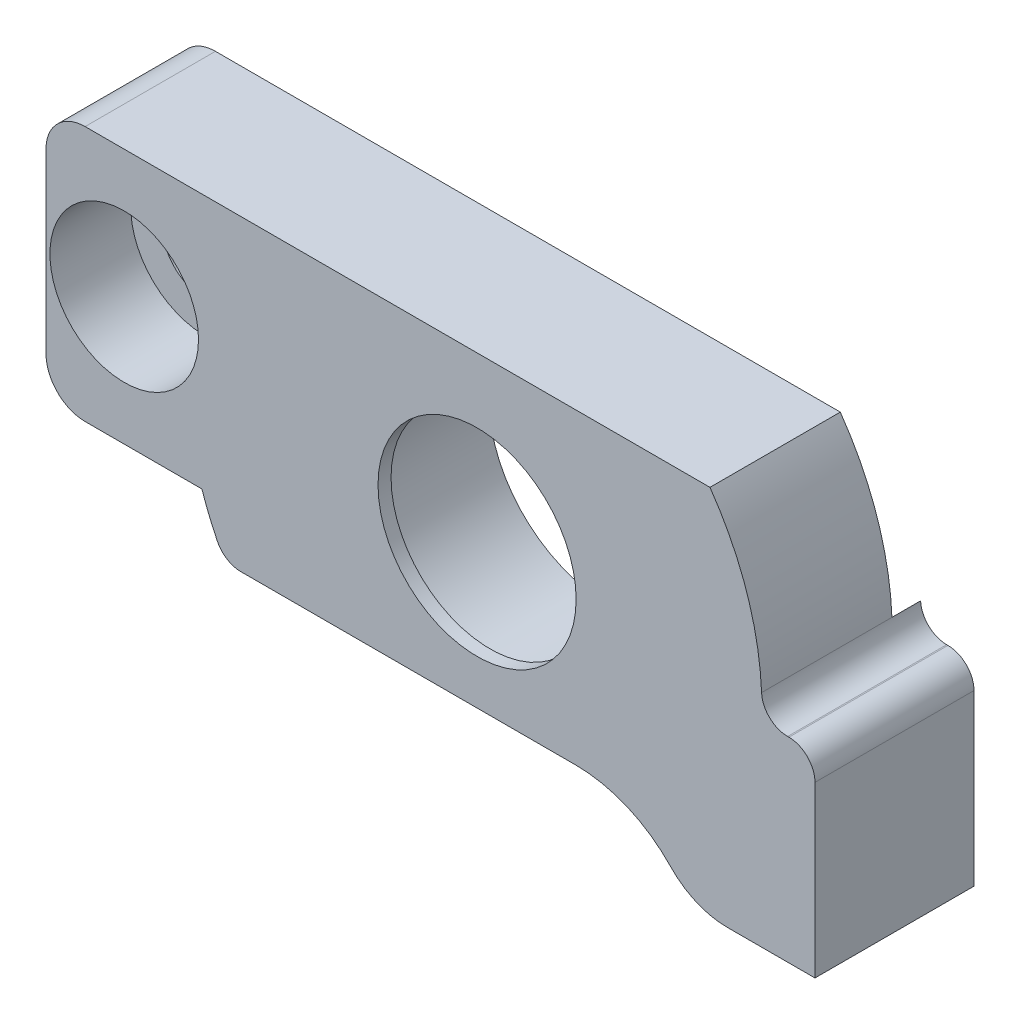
ISO-10303-21;
HEADER;
FILE_DESCRIPTION(('STEP AP214'),'2;1');
FILE_NAME('part.step','',(''),(''),'','','');
FILE_SCHEMA(('AUTOMOTIVE_DESIGN { 1 0 10303 214 1 1 1 1 }'));
ENDSEC;
DATA;
#1=APPLICATION_CONTEXT('core data for automotive mechanical design processes');
#2=APPLICATION_PROTOCOL_DEFINITION('international standard','automotive_design',2000,#1);
#3=PRODUCT_CONTEXT('',#1,'mechanical');
#4=PRODUCT('Part','Part','',(#3));
#5=PRODUCT_RELATED_PRODUCT_CATEGORY('part','',(#4));
#6=PRODUCT_DEFINITION_FORMATION('','',#4);
#7=PRODUCT_DEFINITION_CONTEXT('part definition',#1,'design');
#8=PRODUCT_DEFINITION('design','',#6,#7);
#9=PRODUCT_DEFINITION_SHAPE('','',#8);
#10=(LENGTH_UNIT() NAMED_UNIT(*) SI_UNIT(.MILLI.,.METRE.));
#11=(NAMED_UNIT(*) PLANE_ANGLE_UNIT() SI_UNIT($,.RADIAN.));
#12=(NAMED_UNIT(*) SI_UNIT($,.STERADIAN.) SOLID_ANGLE_UNIT());
#13=UNCERTAINTY_MEASURE_WITH_UNIT(LENGTH_MEASURE(1.E-05),#10,'distance_accuracy_value','');
#14=(GEOMETRIC_REPRESENTATION_CONTEXT(3) GLOBAL_UNCERTAINTY_ASSIGNED_CONTEXT((#13)) GLOBAL_UNIT_ASSIGNED_CONTEXT((#10,
#11,#12)) REPRESENTATION_CONTEXT('',''));
#15=CARTESIAN_POINT('',(0.,0.,0.));
#16=DIRECTION('',(0.,0.,1.));
#17=DIRECTION('',(1.,0.,0.));
#18=AXIS2_PLACEMENT_3D('',#15,#16,#17);
#19=CARTESIAN_POINT('',(12.5,-4.4,-2.4));
#20=DIRECTION('',(-1.,0.,0.));
#21=DIRECTION('',(0.,0.,1.));
#22=AXIS2_PLACEMENT_3D('',#19,#20,#21);
#23=PLANE('',#22);
#24=DIRECTION('',(0.,0.,-1.));
#25=VECTOR('',#24,1.);
#26=CARTESIAN_POINT('',(12.5,-7.2957063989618,13.4233560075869));
#27=LINE('',#26,#25);
#28=CARTESIAN_POINT('',(12.5,-7.2957063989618,0.));
#29=VERTEX_POINT('',#28);
#30=CARTESIAN_POINT('',(12.5,-7.2957063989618,-1.1));
#31=VERTEX_POINT('',#30);
#32=EDGE_CURVE('E178',#29,#31,#27,.T.);
#33=ORIENTED_EDGE('',*,*,#32,.T.);
#34=DIRECTION('',(0.,1.,0.));
#35=VECTOR('',#34,1.);
#36=CARTESIAN_POINT('',(12.5,-8.16413899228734,-1.1));
#37=LINE('',#36,#35);
#38=CARTESIAN_POINT('',(12.5,-8.16413899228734,-1.1));
#39=VERTEX_POINT('',#38);
#40=EDGE_CURVE('E52',#39,#31,#37,.T.);
#41=ORIENTED_EDGE('',*,*,#40,.F.);
#42=DIRECTION('',(0.,0.,-1.));
#43=VECTOR('',#42,1.);
#44=CARTESIAN_POINT('',(12.5,-8.16413899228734,6.00435974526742));
#45=LINE('',#44,#43);
#46=CARTESIAN_POINT('',(12.5,-8.16413899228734,0.));
#47=VERTEX_POINT('',#46);
#48=EDGE_CURVE('E175',#47,#39,#45,.T.);
#49=ORIENTED_EDGE('',*,*,#48,.F.);
#50=DIRECTION('',(0.,1.,0.));
#51=VECTOR('',#50,1.);
#52=CARTESIAN_POINT('',(12.5,-4.4,0.));
#53=LINE('',#52,#51);
#54=EDGE_CURVE('E254',#47,#29,#53,.T.);
#55=ORIENTED_EDGE('',*,*,#54,.T.);
#56=EDGE_LOOP('',(#33,#41,#49,#55));
#57=FACE_BOUND('',#56,.T.);
#58=ADVANCED_FACE('F37',(#57),#23,.T.);
#59=CARTESIAN_POINT('',(14.9616699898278,-0.887184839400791,-2.4));
#60=DIRECTION('',(0.,1.,0.));
#61=DIRECTION('',(-1.,0.,0.));
#62=AXIS2_PLACEMENT_3D('',#59,#60,#61);
#63=PLANE('',#62);
#64=DIRECTION('',(0.,0.,1.));
#65=VECTOR('',#64,1.);
#66=CARTESIAN_POINT('',(16.0000000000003,-0.887184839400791,-2.4));
#67=LINE('',#66,#65);
#68=CARTESIAN_POINT('',(16.0000000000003,-0.887184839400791,5.));
#69=VERTEX_POINT('',#68);
#70=CARTESIAN_POINT('',(16.0000000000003,-0.887184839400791,-1.1));
#71=VERTEX_POINT('',#70);
#72=EDGE_CURVE('E277',#69,#71,#67,.F.);
#73=ORIENTED_EDGE('',*,*,#72,.T.);
#74=DIRECTION('',(1.,0.,0.));
#75=VECTOR('',#74,1.);
#76=CARTESIAN_POINT('',(15.9511831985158,-0.88718483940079,-1.1));
#77=LINE('',#76,#75);
#78=CARTESIAN_POINT('',(15.9511831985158,-0.887184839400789,-1.1));
#79=VERTEX_POINT('',#78);
#80=EDGE_CURVE('E338',#79,#71,#77,.T.);
#81=ORIENTED_EDGE('',*,*,#80,.F.);
#82=DIRECTION('',(0.,0.,-1.));
#83=VECTOR('',#82,1.);
#84=CARTESIAN_POINT('',(15.9511831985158,-0.887184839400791,5.));
#85=LINE('',#84,#83);
#86=CARTESIAN_POINT('',(15.9511831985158,-0.887184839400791,5.));
#87=VERTEX_POINT('',#86);
#88=EDGE_CURVE('E284',#79,#87,#85,.F.);
#89=ORIENTED_EDGE('',*,*,#88,.T.);
#90=DIRECTION('',(-1.,0.,0.));
#91=VECTOR('',#90,1.);
#92=CARTESIAN_POINT('',(14.9616699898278,-0.887184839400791,5.));
#93=LINE('',#92,#91);
#94=EDGE_CURVE('E207',#69,#87,#93,.T.);
#95=ORIENTED_EDGE('',*,*,#94,.F.);
#96=EDGE_LOOP('',(#73,#81,#89,#95));
#97=FACE_BOUND('',#96,.T.);
#98=ADVANCED_FACE('F371',(#97),#63,.T.);
#99=CARTESIAN_POINT('',(17.0000000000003,-0.887184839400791,-2.4));
#100=DIRECTION('',(1.,0.,0.));
#101=DIRECTION('',(0.,0.,-1.));
#102=AXIS2_PLACEMENT_3D('',#99,#100,#101);
#103=PLANE('',#102);
#104=DIRECTION('',(0.,0.,1.));
#105=VECTOR('',#104,1.);
#106=CARTESIAN_POINT('',(17.0000000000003,-8.38718483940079,-2.4));
#107=LINE('',#106,#105);
#108=CARTESIAN_POINT('',(17.0000000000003,-8.38718483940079,-1.1));
#109=VERTEX_POINT('',#108);
#110=CARTESIAN_POINT('',(17.0000000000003,-8.38718483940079,5.));
#111=VERTEX_POINT('',#110);
#112=EDGE_CURVE('E211',#109,#111,#107,.T.);
#113=ORIENTED_EDGE('',*,*,#112,.F.);
#114=DIRECTION('',(0.,-1.,0.));
#115=VECTOR('',#114,1.);
#116=CARTESIAN_POINT('',(17.0000000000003,-1.88718483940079,-1.1));
#117=LINE('',#116,#115);
#118=CARTESIAN_POINT('',(17.0000000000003,-1.88718483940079,-1.1));
#119=VERTEX_POINT('',#118);
#120=EDGE_CURVE('E334',#119,#109,#117,.T.);
#121=ORIENTED_EDGE('',*,*,#120,.F.);
#122=DIRECTION('',(0.,0.,1.));
#123=VECTOR('',#122,1.);
#124=CARTESIAN_POINT('',(17.0000000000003,-1.88718483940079,-2.4));
#125=LINE('',#124,#123);
#126=CARTESIAN_POINT('',(17.0000000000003,-1.88718483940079,5.));
#127=VERTEX_POINT('',#126);
#128=EDGE_CURVE('E290',#119,#127,#125,.T.);
#129=ORIENTED_EDGE('',*,*,#128,.T.);
#130=DIRECTION('',(0.,1.,0.));
#131=VECTOR('',#130,1.);
#132=CARTESIAN_POINT('',(17.0000000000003,-0.887184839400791,5.));
#133=LINE('',#132,#131);
#134=EDGE_CURVE('E204',#111,#127,#133,.T.);
#135=ORIENTED_EDGE('',*,*,#134,.F.);
#136=EDGE_LOOP('',(#113,#121,#129,#135));
#137=FACE_BOUND('',#136,.T.);
#138=ADVANCED_FACE('F364',(#137),#103,.T.);
#139=CARTESIAN_POINT('',(17.0000000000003,-8.38718483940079,-2.4));
#140=DIRECTION('',(0.,-1.,0.));
#141=DIRECTION('',(1.,0.,0.));
#142=AXIS2_PLACEMENT_3D('',#139,#140,#141);
#143=PLANE('',#142);
#144=DIRECTION('',(0.,0.,1.));
#145=VECTOR('',#144,1.);
#146=CARTESIAN_POINT('',(13.6351324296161,-8.38718483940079,-2.4));
#147=LINE('',#146,#145);
#148=CARTESIAN_POINT('',(13.6351324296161,-8.38718483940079,5.));
#149=VERTEX_POINT('',#148);
#150=CARTESIAN_POINT('',(13.6351324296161,-8.38718483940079,-1.1));
#151=VERTEX_POINT('',#150);
#152=EDGE_CURVE('E300',#149,#151,#147,.F.);
#153=ORIENTED_EDGE('',*,*,#152,.T.);
#154=DIRECTION('',(-1.,0.,0.));
#155=VECTOR('',#154,1.);
#156=CARTESIAN_POINT('',(17.0000000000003,-8.38718483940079,-1.1));
#157=LINE('',#156,#155);
#158=EDGE_CURVE('E165',#109,#151,#157,.T.);
#159=ORIENTED_EDGE('',*,*,#158,.F.);
#160=ORIENTED_EDGE('',*,*,#112,.T.);
#161=DIRECTION('',(1.,0.,0.));
#162=VECTOR('',#161,1.);
#163=CARTESIAN_POINT('',(17.0000000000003,-8.38718483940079,5.));
#164=LINE('',#163,#162);
#165=EDGE_CURVE('E201',#149,#111,#164,.T.);
#166=ORIENTED_EDGE('',*,*,#165,.F.);
#167=EDGE_LOOP('',(#153,#159,#160,#166));
#168=FACE_BOUND('',#167,.T.);
#169=ADVANCED_FACE('F360',(#168),#143,.T.);
#170=CARTESIAN_POINT('',(15.9511831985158,0.112815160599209,-2.4));
#171=DIRECTION('',(0.,0.,1.));
#172=DIRECTION('',(1.,0.,0.));
#173=AXIS2_PLACEMENT_3D('',#170,#171,#172);
#174=CYLINDRICAL_SURFACE('',#173,1.);
#175=CARTESIAN_POINT('',(15.9511831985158,0.112815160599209,-1.1));
#176=DIRECTION('',(0.,0.,1.));
#177=DIRECTION('',(-1.,0.,0.));
#178=AXIS2_PLACEMENT_3D('',#175,#176,#177);
#179=CIRCLE('',#178,0.999999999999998);
#180=CARTESIAN_POINT('',(14.9520625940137,0.0708864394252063,-1.1));
#181=VERTEX_POINT('',#180);
#182=EDGE_CURVE('E340',#181,#79,#179,.T.);
#183=ORIENTED_EDGE('',*,*,#182,.F.);
#184=DIRECTION('',(0.,0.,1.));
#185=VECTOR('',#184,1.);
#186=CARTESIAN_POINT('',(14.9520625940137,0.0708864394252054,-2.4));
#187=LINE('',#186,#185);
#188=CARTESIAN_POINT('',(14.9520625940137,0.0708864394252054,0.));
#189=VERTEX_POINT('',#188);
#190=EDGE_CURVE('E286',#189,#181,#187,.F.);
#191=ORIENTED_EDGE('',*,*,#190,.F.);
#192=CARTESIAN_POINT('',(14.9520625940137,0.0708864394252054,5.));
#193=VERTEX_POINT('',#192);
#194=EDGE_CURVE('E287',#193,#189,#187,.F.);
#195=ORIENTED_EDGE('',*,*,#194,.F.);
#196=CARTESIAN_POINT('',(15.9511831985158,0.112815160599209,5.));
#197=DIRECTION('',(0.,0.,1.));
#198=DIRECTION('',(1.,0.,0.));
#199=AXIS2_PLACEMENT_3D('',#196,#197,#198);
#200=CIRCLE('',#199,1.);
#201=EDGE_CURVE('E294',#87,#193,#200,.F.);
#202=ORIENTED_EDGE('',*,*,#201,.F.);
#203=ORIENTED_EDGE('',*,*,#88,.F.);
#204=EDGE_LOOP('',(#183,#191,#195,#202,#203));
#205=FACE_BOUND('',#204,.T.);
#206=ADVANCED_FACE('F349',(#205),#174,.F.);
#207=CARTESIAN_POINT('',(16.0000000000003,-1.88718483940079,-2.4));
#208=DIRECTION('',(0.,0.,1.));
#209=DIRECTION('',(1.,0.,0.));
#210=AXIS2_PLACEMENT_3D('',#207,#208,#209);
#211=CYLINDRICAL_SURFACE('',#210,1.);
#212=ORIENTED_EDGE('',*,*,#128,.F.);
#213=CARTESIAN_POINT('',(16.0000000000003,-1.88718483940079,-1.1));
#214=DIRECTION('',(0.,0.,-1.));
#215=DIRECTION('',(-1.,0.,0.));
#216=AXIS2_PLACEMENT_3D('',#213,#214,#215);
#217=CIRCLE('',#216,1.);
#218=EDGE_CURVE('E336',#71,#119,#217,.T.);
#219=ORIENTED_EDGE('',*,*,#218,.F.);
#220=ORIENTED_EDGE('',*,*,#72,.F.);
#221=CARTESIAN_POINT('',(16.0000000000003,-1.88718483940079,5.));
#222=DIRECTION('',(0.,0.,1.));
#223=DIRECTION('',(1.,0.,0.));
#224=AXIS2_PLACEMENT_3D('',#221,#222,#223);
#225=CIRCLE('',#224,1.);
#226=EDGE_CURVE('E292',#127,#69,#225,.T.);
#227=ORIENTED_EDGE('',*,*,#226,.F.);
#228=EDGE_LOOP('',(#212,#219,#220,#227));
#229=FACE_BOUND('',#228,.T.);
#230=ADVANCED_FACE('F373',(#229),#211,.T.);
#231=CARTESIAN_POINT('',(13.6351324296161,-5.38718483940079,-2.4));
#232=DIRECTION('',(0.,0.,1.));
#233=DIRECTION('',(1.,0.,0.));
#234=AXIS2_PLACEMENT_3D('',#231,#232,#233);
#235=CYLINDRICAL_SURFACE('',#234,3.);
#236=ORIENTED_EDGE('',*,*,#48,.T.);
#237=CARTESIAN_POINT('',(13.6351324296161,-5.38718483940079,-1.1));
#238=DIRECTION('',(0.,0.,-1.));
#239=DIRECTION('',(-1.,0.,0.));
#240=AXIS2_PLACEMENT_3D('',#237,#238,#239);
#241=CIRCLE('',#240,3.);
#242=EDGE_CURVE('E162',#151,#39,#241,.T.);
#243=ORIENTED_EDGE('',*,*,#242,.F.);
#244=ORIENTED_EDGE('',*,*,#152,.F.);
#245=CARTESIAN_POINT('',(13.6351324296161,-5.38718483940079,5.));
#246=DIRECTION('',(0.,0.,1.));
#247=DIRECTION('',(1.,0.,0.));
#248=AXIS2_PLACEMENT_3D('',#245,#246,#247);
#249=CIRCLE('',#248,3.);
#250=CARTESIAN_POINT('',(11.465218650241,-7.45877219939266,5.));
#251=VERTEX_POINT('',#250);
#252=EDGE_CURVE('E298',#251,#149,#249,.T.);
#253=ORIENTED_EDGE('',*,*,#252,.F.);
#254=DIRECTION('',(0.,0.,1.));
#255=VECTOR('',#254,1.);
#256=CARTESIAN_POINT('',(11.465218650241,-7.45877219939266,-2.4));
#257=LINE('',#256,#255);
#258=CARTESIAN_POINT('',(11.465218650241,-7.45877219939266,0.));
#259=VERTEX_POINT('',#258);
#260=EDGE_CURVE('E296',#259,#251,#257,.T.);
#261=ORIENTED_EDGE('',*,*,#260,.F.);
#262=CARTESIAN_POINT('',(13.6351324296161,-5.38718483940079,0.));
#263=DIRECTION('',(0.,0.,1.));
#264=DIRECTION('',(1.,0.,0.));
#265=AXIS2_PLACEMENT_3D('',#262,#263,#264);
#266=CIRCLE('',#265,3.);
#267=EDGE_CURVE('E183',#47,#259,#266,.F.);
#268=ORIENTED_EDGE('',*,*,#267,.F.);
#269=EDGE_LOOP('',(#236,#243,#244,#253,#261,#268));
#270=FACE_BOUND('',#269,.T.);
#271=ADVANCED_FACE('F181',(#270),#235,.T.);
#272=CARTESIAN_POINT('',(4.03666998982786,-0.387184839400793,13.4233560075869));
#273=DIRECTION('',(0.,0.,-1.));
#274=DIRECTION('',(-1.,0.,0.));
#275=AXIS2_PLACEMENT_3D('',#272,#273,#274);
#276=CYLINDRICAL_SURFACE('',#275,10.925);
#277=CARTESIAN_POINT('',(4.03666998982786,-0.387184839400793,-1.1));
#278=DIRECTION('',(0.,0.,1.));
#279=DIRECTION('',(-1.,0.,0.));
#280=AXIS2_PLACEMENT_3D('',#277,#278,#279);
#281=CIRCLE('',#280,10.925);
#282=EDGE_CURVE('E179',#31,#181,#281,.T.);
#283=ORIENTED_EDGE('',*,*,#282,.F.);
#284=ORIENTED_EDGE('',*,*,#32,.F.);
#285=CARTESIAN_POINT('',(4.03666998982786,-0.387184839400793,0.));
#286=DIRECTION('',(0.,0.,1.));
#287=DIRECTION('',(1.,0.,0.));
#288=AXIS2_PLACEMENT_3D('',#285,#286,#287);
#289=CIRCLE('',#288,10.925);
#290=EDGE_CURVE('E332',#189,#29,#289,.F.);
#291=ORIENTED_EDGE('',*,*,#290,.F.);
#292=ORIENTED_EDGE('',*,*,#190,.T.);
#293=EDGE_LOOP('',(#283,#284,#291,#292));
#294=FACE_BOUND('',#293,.T.);
#295=ADVANCED_FACE('F352',(#294),#276,.F.);
#296=CARTESIAN_POINT('',(-11.,5.9,5.));
#297=DIRECTION('',(0.,-1.,0.));
#298=DIRECTION('',(0.,0.,-1.));
#299=AXIS2_PLACEMENT_3D('',#296,#297,#298);
#300=PLANE('',#299);
#301=DIRECTION('',(0.,0.,1.));
#302=VECTOR('',#301,1.);
#303=CARTESIAN_POINT('',(12.9712618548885,5.9,-2.4));
#304=LINE('',#303,#302);
#305=CARTESIAN_POINT('',(12.9712618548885,5.9,0.));
#306=VERTEX_POINT('',#305);
#307=CARTESIAN_POINT('',(12.9712618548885,5.9,5.));
#308=VERTEX_POINT('',#307);
#309=EDGE_CURVE('E210',#306,#308,#304,.T.);
#310=ORIENTED_EDGE('',*,*,#309,.F.);
#311=DIRECTION('',(-1.,0.,0.));
#312=VECTOR('',#311,1.);
#313=CARTESIAN_POINT('',(-11.,5.9,0.));
#314=LINE('',#313,#312);
#315=CARTESIAN_POINT('',(-11.,5.9,0.));
#316=VERTEX_POINT('',#315);
#317=EDGE_CURVE('E256',#306,#316,#314,.T.);
#318=ORIENTED_EDGE('',*,*,#317,.T.);
#319=DIRECTION('',(0.,0.,-1.));
#320=VECTOR('',#319,1.);
#321=CARTESIAN_POINT('',(-11.,5.9,5.));
#322=LINE('',#321,#320);
#323=CARTESIAN_POINT('',(-11.,5.9,5.));
#324=VERTEX_POINT('',#323);
#325=EDGE_CURVE('E274',#324,#316,#322,.T.);
#326=ORIENTED_EDGE('',*,*,#325,.F.);
#327=DIRECTION('',(-1.,0.,0.));
#328=VECTOR('',#327,1.);
#329=CARTESIAN_POINT('',(-11.,5.9,5.));
#330=LINE('',#329,#328);
#331=EDGE_CURVE('E240',#308,#324,#330,.T.);
#332=ORIENTED_EDGE('',*,*,#331,.F.);
#333=EDGE_LOOP('',(#310,#318,#326,#332));
#334=FACE_BOUND('',#333,.T.);
#335=ADVANCED_FACE('F438',(#334),#300,.F.);
#336=CARTESIAN_POINT('',(-4.49999999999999,-5.9,5.));
#337=DIRECTION('',(0.,1.,0.));
#338=DIRECTION('',(0.,0.,1.));
#339=AXIS2_PLACEMENT_3D('',#336,#337,#338);
#340=PLANE('',#339);
#341=DIRECTION('',(1.,0.,0.));
#342=VECTOR('',#341,1.);
#343=CARTESIAN_POINT('',(-4.49999999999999,-5.9,5.));
#344=LINE('',#343,#342);
#345=CARTESIAN_POINT('',(-5.02700058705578,-5.9,5.));
#346=VERTEX_POINT('',#345);
#347=CARTESIAN_POINT('',(7.8220096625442,-5.9,5.));
#348=VERTEX_POINT('',#347);
#349=EDGE_CURVE('E238',#346,#348,#344,.T.);
#350=ORIENTED_EDGE('',*,*,#349,.F.);
#351=DIRECTION('',(0.,0.,-1.));
#352=VECTOR('',#351,1.);
#353=CARTESIAN_POINT('',(-5.02700058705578,-5.9,0.));
#354=LINE('',#353,#352);
#355=CARTESIAN_POINT('',(-5.02700058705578,-5.9,0.));
#356=VERTEX_POINT('',#355);
#357=EDGE_CURVE('E45',#346,#356,#354,.T.);
#358=ORIENTED_EDGE('',*,*,#357,.T.);
#359=DIRECTION('',(1.,0.,0.));
#360=VECTOR('',#359,1.);
#361=CARTESIAN_POINT('',(-4.49999999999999,-5.9,0.));
#362=LINE('',#361,#360);
#363=CARTESIAN_POINT('',(7.8220096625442,-5.9,0.));
#364=VERTEX_POINT('',#363);
#365=EDGE_CURVE('E234',#356,#364,#362,.T.);
#366=ORIENTED_EDGE('',*,*,#365,.T.);
#367=DIRECTION('',(0.,0.,1.));
#368=VECTOR('',#367,1.);
#369=CARTESIAN_POINT('',(7.8220096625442,-5.9,-2.4));
#370=LINE('',#369,#368);
#371=EDGE_CURVE('E214',#364,#348,#370,.T.);
#372=ORIENTED_EDGE('',*,*,#371,.T.);
#373=EDGE_LOOP('',(#350,#358,#366,#372));
#374=FACE_BOUND('',#373,.T.);
#375=ADVANCED_FACE('F310',(#374),#340,.F.);
#376=CARTESIAN_POINT('',(-11.,4.4,5.));
#377=DIRECTION('',(0.,0.,-1.));
#378=DIRECTION('',(-1.,0.,0.));
#379=AXIS2_PLACEMENT_3D('',#376,#377,#378);
#380=CYLINDRICAL_SURFACE('',#379,1.5);
#381=CARTESIAN_POINT('',(-11.,4.4,0.));
#382=DIRECTION('',(0.,0.,1.));
#383=DIRECTION('',(-1.,0.,0.));
#384=AXIS2_PLACEMENT_3D('',#381,#382,#383);
#385=CIRCLE('',#384,1.5);
#386=CARTESIAN_POINT('',(-12.5,4.4,0.));
#387=VERTEX_POINT('',#386);
#388=EDGE_CURVE('E258',#316,#387,#385,.T.);
#389=ORIENTED_EDGE('',*,*,#388,.T.);
#390=DIRECTION('',(0.,0.,-1.));
#391=VECTOR('',#390,1.);
#392=CARTESIAN_POINT('',(-12.5,4.4,5.));
#393=LINE('',#392,#391);
#394=CARTESIAN_POINT('',(-12.5,4.4,5.));
#395=VERTEX_POINT('',#394);
#396=EDGE_CURVE('E271',#395,#387,#393,.T.);
#397=ORIENTED_EDGE('',*,*,#396,.F.);
#398=CARTESIAN_POINT('',(-11.,4.4,5.));
#399=DIRECTION('',(0.,0.,1.));
#400=DIRECTION('',(-1.,0.,0.));
#401=AXIS2_PLACEMENT_3D('',#398,#399,#400);
#402=CIRCLE('',#401,1.5);
#403=EDGE_CURVE('E243',#324,#395,#402,.T.);
#404=ORIENTED_EDGE('',*,*,#403,.F.);
#405=ORIENTED_EDGE('',*,*,#325,.T.);
#406=EDGE_LOOP('',(#389,#397,#404,#405));
#407=FACE_BOUND('',#406,.T.);
#408=ADVANCED_FACE('F433',(#407),#380,.T.);
#409=CARTESIAN_POINT('',(-12.5,-2.4,5.));
#410=DIRECTION('',(1.,0.,0.));
#411=DIRECTION('',(0.,0.,-1.));
#412=AXIS2_PLACEMENT_3D('',#409,#410,#411);
#413=PLANE('',#412);
#414=DIRECTION('',(0.,-1.,0.));
#415=VECTOR('',#414,1.);
#416=CARTESIAN_POINT('',(-12.5,-2.4,0.));
#417=LINE('',#416,#415);
#418=CARTESIAN_POINT('',(-12.5,-2.4,0.));
#419=VERTEX_POINT('',#418);
#420=EDGE_CURVE('E260',#387,#419,#417,.T.);
#421=ORIENTED_EDGE('',*,*,#420,.T.);
#422=DIRECTION('',(0.,0.,-1.));
#423=VECTOR('',#422,1.);
#424=CARTESIAN_POINT('',(-12.5,-2.4,5.));
#425=LINE('',#424,#423);
#426=CARTESIAN_POINT('',(-12.5,-2.4,5.));
#427=VERTEX_POINT('',#426);
#428=EDGE_CURVE('E268',#427,#419,#425,.T.);
#429=ORIENTED_EDGE('',*,*,#428,.F.);
#430=DIRECTION('',(0.,-1.,0.));
#431=VECTOR('',#430,1.);
#432=CARTESIAN_POINT('',(-12.5,-2.4,5.));
#433=LINE('',#432,#431);
#434=EDGE_CURVE('E245',#395,#427,#433,.T.);
#435=ORIENTED_EDGE('',*,*,#434,.F.);
#436=ORIENTED_EDGE('',*,*,#396,.T.);
#437=EDGE_LOOP('',(#421,#429,#435,#436));
#438=FACE_BOUND('',#437,.T.);
#439=ADVANCED_FACE('F429',(#438),#413,.F.);
#440=CARTESIAN_POINT('',(-11.,-2.4,5.));
#441=DIRECTION('',(0.,0.,-1.));
#442=DIRECTION('',(-1.,0.,0.));
#443=AXIS2_PLACEMENT_3D('',#440,#441,#442);
#444=CYLINDRICAL_SURFACE('',#443,1.5);
#445=CARTESIAN_POINT('',(-11.,-2.4,0.));
#446=DIRECTION('',(0.,0.,1.));
#447=DIRECTION('',(1.,0.,0.));
#448=AXIS2_PLACEMENT_3D('',#445,#446,#447);
#449=CIRCLE('',#448,1.5);
#450=CARTESIAN_POINT('',(-11.,-3.9,0.));
#451=VERTEX_POINT('',#450);
#452=EDGE_CURVE('E262',#419,#451,#449,.T.);
#453=ORIENTED_EDGE('',*,*,#452,.T.);
#454=DIRECTION('',(0.,0.,-1.));
#455=VECTOR('',#454,1.);
#456=CARTESIAN_POINT('',(-11.,-3.9,5.));
#457=LINE('',#456,#455);
#458=CARTESIAN_POINT('',(-11.,-3.9,5.));
#459=VERTEX_POINT('',#458);
#460=EDGE_CURVE('E252',#459,#451,#457,.T.);
#461=ORIENTED_EDGE('',*,*,#460,.F.);
#462=CARTESIAN_POINT('',(-11.,-2.4,5.));
#463=DIRECTION('',(0.,0.,1.));
#464=DIRECTION('',(1.,0.,0.));
#465=AXIS2_PLACEMENT_3D('',#462,#463,#464);
#466=CIRCLE('',#465,1.5);
#467=EDGE_CURVE('E247',#427,#459,#466,.T.);
#468=ORIENTED_EDGE('',*,*,#467,.F.);
#469=ORIENTED_EDGE('',*,*,#428,.T.);
#470=EDGE_LOOP('',(#453,#461,#468,#469));
#471=FACE_BOUND('',#470,.T.);
#472=ADVANCED_FACE('F425',(#471),#444,.T.);
#473=CARTESIAN_POINT('',(-11.,-3.9,5.));
#474=DIRECTION('',(0.,1.,0.));
#475=DIRECTION('',(0.,0.,1.));
#476=AXIS2_PLACEMENT_3D('',#473,#474,#475);
#477=PLANE('',#476);
#478=DIRECTION('',(1.,0.,0.));
#479=VECTOR('',#478,1.);
#480=CARTESIAN_POINT('',(-11.,-3.9,0.));
#481=LINE('',#480,#479);
#482=CARTESIAN_POINT('',(-6.51916984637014,-3.9,0.));
#483=VERTEX_POINT('',#482);
#484=EDGE_CURVE('E241',#451,#483,#481,.T.);
#485=ORIENTED_EDGE('',*,*,#484,.T.);
#486=DIRECTION('',(0.,0.,1.));
#487=VECTOR('',#486,1.);
#488=CARTESIAN_POINT('',(-6.51916984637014,-3.9,-2.84201457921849));
#489=LINE('',#488,#487);
#490=CARTESIAN_POINT('',(-6.51916984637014,-3.9,5.));
#491=VERTEX_POINT('',#490);
#492=EDGE_CURVE('E188',#483,#491,#489,.T.);
#493=ORIENTED_EDGE('',*,*,#492,.T.);
#494=DIRECTION('',(1.,0.,0.));
#495=VECTOR('',#494,1.);
#496=CARTESIAN_POINT('',(-11.,-3.9,5.));
#497=LINE('',#496,#495);
#498=EDGE_CURVE('E249',#459,#491,#497,.T.);
#499=ORIENTED_EDGE('',*,*,#498,.F.);
#500=ORIENTED_EDGE('',*,*,#460,.T.);
#501=EDGE_LOOP('',(#485,#493,#499,#500));
#502=FACE_BOUND('',#501,.T.);
#503=ADVANCED_FACE('F420',(#502),#477,.F.);
#504=CARTESIAN_POINT('',(-6.4,-4.8,5.));
#505=DIRECTION('',(0.,0.,1.));
#506=DIRECTION('',(1.,0.,0.));
#507=AXIS2_PLACEMENT_3D('',#504,#505,#506);
#508=PLANE('',#507);
#509=CARTESIAN_POINT('',(4.03666998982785,-0.387184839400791,5.));
#510=DIRECTION('',(0.,0.,1.));
#511=DIRECTION('',(1.,0.,0.));
#512=AXIS2_PLACEMENT_3D('',#509,#510,#511);
#513=CIRCLE('',#512,11.125);
#514=CARTESIAN_POINT('',(-5.92217792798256,-5.34571013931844,5.));
#515=VERTEX_POINT('',#514);
#516=EDGE_CURVE('E324',#491,#515,#513,.T.);
#517=ORIENTED_EDGE('',*,*,#516,.T.);
#518=CARTESIAN_POINT('',(-5.02700058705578,-4.9,5.));
#519=DIRECTION('',(0.,0.,1.));
#520=DIRECTION('',(1.,0.,0.));
#521=AXIS2_PLACEMENT_3D('',#518,#519,#520);
#522=CIRCLE('',#521,1.);
#523=EDGE_CURVE('E305',#515,#346,#522,.T.);
#524=ORIENTED_EDGE('',*,*,#523,.T.);
#525=ORIENTED_EDGE('',*,*,#349,.T.);
#526=CARTESIAN_POINT('',(7.8220096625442,-10.9368945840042,5.));
#527=DIRECTION('',(0.,0.,-1.));
#528=DIRECTION('',(1.,0.,0.));
#529=AXIS2_PLACEMENT_3D('',#526,#527,#528);
#530=CIRCLE('',#529,5.03689458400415);
#531=EDGE_CURVE('E198',#348,#251,#530,.T.);
#532=ORIENTED_EDGE('',*,*,#531,.T.);
#533=ORIENTED_EDGE('',*,*,#252,.T.);
#534=ORIENTED_EDGE('',*,*,#165,.T.);
#535=ORIENTED_EDGE('',*,*,#134,.T.);
#536=ORIENTED_EDGE('',*,*,#226,.T.);
#537=ORIENTED_EDGE('',*,*,#94,.T.);
#538=ORIENTED_EDGE('',*,*,#201,.T.);
#539=CARTESIAN_POINT('',(4.03666998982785,-0.387184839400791,5.));
#540=DIRECTION('',(0.,0.,1.));
#541=DIRECTION('',(1.,0.,0.));
#542=AXIS2_PLACEMENT_3D('',#539,#540,#541);
#543=CIRCLE('',#542,10.925);
#544=EDGE_CURVE('E194',#193,#308,#543,.T.);
#545=ORIENTED_EDGE('',*,*,#544,.T.);
#546=ORIENTED_EDGE('',*,*,#331,.T.);
#547=ORIENTED_EDGE('',*,*,#403,.T.);
#548=ORIENTED_EDGE('',*,*,#434,.T.);
#549=ORIENTED_EDGE('',*,*,#467,.T.);
#550=ORIENTED_EDGE('',*,*,#498,.T.);
#551=EDGE_LOOP('',(#517,#524,#525,#532,#533,#534,#535,#536,#537,#538,#545,#546,#547,#548,#549,#550));
#552=FACE_BOUND('',#551,.T.);
#553=CARTESIAN_POINT('',(-9.49999999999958,1.00000000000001,5.));
#554=DIRECTION('',(0.,0.,-1.));
#555=DIRECTION('',(-1.,0.,0.));
#556=AXIS2_PLACEMENT_3D('',#553,#554,#555);
#557=CIRCLE('',#556,2.85000000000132);
#558=CARTESIAN_POINT('',(-6.64999999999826,1.00000000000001,5.));
#559=VERTEX_POINT('',#558);
#560=EDGE_CURVE('E228',#559,#559,#557,.T.);
#561=ORIENTED_EDGE('',*,*,#560,.T.);
#562=EDGE_LOOP('',(#561));
#563=FACE_BOUND('',#562,.T.);
#564=CARTESIAN_POINT('',(4.03666998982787,-0.387184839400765,5.));
#565=DIRECTION('',(0.,0.,1.));
#566=DIRECTION('',(1.,0.,0.));
#567=AXIS2_PLACEMENT_3D('',#564,#565,#566);
#568=CIRCLE('',#567,3.79999999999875);
#569=CARTESIAN_POINT('',(7.83666998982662,-0.387184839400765,5.));
#570=VERTEX_POINT('',#569);
#571=EDGE_CURVE('E231',#570,#570,#568,.T.);
#572=ORIENTED_EDGE('',*,*,#571,.F.);
#573=EDGE_LOOP('',(#572));
#574=FACE_BOUND('',#573,.T.);
#575=ADVANCED_FACE('F326',(#552,#563,#574),#508,.T.);
#576=CARTESIAN_POINT('',(-6.4,-4.8,0.));
#577=DIRECTION('',(0.,0.,1.));
#578=DIRECTION('',(1.,0.,0.));
#579=AXIS2_PLACEMENT_3D('',#576,#577,#578);
#580=PLANE('',#579);
#581=ORIENTED_EDGE('',*,*,#365,.F.);
#582=CARTESIAN_POINT('',(-5.02700058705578,-4.9,0.));
#583=DIRECTION('',(0.,0.,1.));
#584=DIRECTION('',(1.,0.,0.));
#585=AXIS2_PLACEMENT_3D('',#582,#583,#584);
#586=CIRCLE('',#585,1.);
#587=CARTESIAN_POINT('',(-5.92217792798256,-5.34571013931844,0.));
#588=VERTEX_POINT('',#587);
#589=EDGE_CURVE('E12',#356,#588,#586,.F.);
#590=ORIENTED_EDGE('',*,*,#589,.T.);
#591=CARTESIAN_POINT('',(4.03666998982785,-0.387184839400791,0.));
#592=DIRECTION('',(0.,0.,1.));
#593=DIRECTION('',(1.,0.,0.));
#594=AXIS2_PLACEMENT_3D('',#591,#592,#593);
#595=CIRCLE('',#594,11.125);
#596=EDGE_CURVE('E184',#588,#483,#595,.F.);
#597=ORIENTED_EDGE('',*,*,#596,.T.);
#598=ORIENTED_EDGE('',*,*,#484,.F.);
#599=ORIENTED_EDGE('',*,*,#452,.F.);
#600=ORIENTED_EDGE('',*,*,#420,.F.);
#601=ORIENTED_EDGE('',*,*,#388,.F.);
#602=ORIENTED_EDGE('',*,*,#317,.F.);
#603=EDGE_CURVE('E60',#306,#189,#289,.F.);
#604=ORIENTED_EDGE('',*,*,#603,.T.);
#605=ORIENTED_EDGE('',*,*,#290,.T.);
#606=ORIENTED_EDGE('',*,*,#54,.F.);
#607=ORIENTED_EDGE('',*,*,#267,.T.);
#608=CARTESIAN_POINT('',(7.8220096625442,-10.9368945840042,0.));
#609=DIRECTION('',(0.,0.,1.));
#610=DIRECTION('',(1.,0.,0.));
#611=AXIS2_PLACEMENT_3D('',#608,#609,#610);
#612=CIRCLE('',#611,5.03689458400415);
#613=EDGE_CURVE('E186',#364,#259,#612,.F.);
#614=ORIENTED_EDGE('',*,*,#613,.F.);
#615=EDGE_LOOP('',(#581,#590,#597,#598,#599,#600,#601,#602,#604,#605,#606,#607,#614));
#616=FACE_BOUND('',#615,.T.);
#617=CARTESIAN_POINT('',(4.03666998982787,-0.387184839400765,0.));
#618=DIRECTION('',(0.,0.,-1.));
#619=DIRECTION('',(-1.,0.,0.));
#620=AXIS2_PLACEMENT_3D('',#617,#618,#619);
#621=CIRCLE('',#620,4.55000000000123);
#622=CARTESIAN_POINT('',(-0.51333001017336,-0.387184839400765,0.));
#623=VERTEX_POINT('',#622);
#624=EDGE_CURVE('E213',#623,#623,#621,.T.);
#625=ORIENTED_EDGE('',*,*,#624,.F.);
#626=EDGE_LOOP('',(#625));
#627=FACE_BOUND('',#626,.T.);
#628=CARTESIAN_POINT('',(-9.49999999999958,1.00000000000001,0.));
#629=DIRECTION('',(0.,0.,1.));
#630=DIRECTION('',(1.,0.,0.));
#631=AXIS2_PLACEMENT_3D('',#628,#629,#630);
#632=CIRCLE('',#631,1.64999999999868);
#633=CARTESIAN_POINT('',(-7.8500000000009,1.00000000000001,0.));
#634=VERTEX_POINT('',#633);
#635=EDGE_CURVE('E235',#634,#634,#632,.T.);
#636=ORIENTED_EDGE('',*,*,#635,.T.);
#637=EDGE_LOOP('',(#636));
#638=FACE_BOUND('',#637,.T.);
#639=ADVANCED_FACE('F314',(#616,#627,#638),#580,.F.);
#640=CARTESIAN_POINT('',(-9.49999999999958,1.00000000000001,0.));
#641=DIRECTION('',(0.,0.,1.));
#642=DIRECTION('',(1.,0.,0.));
#643=AXIS2_PLACEMENT_3D('',#640,#641,#642);
#644=CYLINDRICAL_SURFACE('',#643,1.64999999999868);
#645=CARTESIAN_POINT('',(-9.49999999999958,1.00000000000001,1.9));
#646=DIRECTION('',(0.,0.,-1.));
#647=DIRECTION('',(-1.,0.,0.));
#648=AXIS2_PLACEMENT_3D('',#645,#646,#647);
#649=CIRCLE('',#648,1.64999999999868);
#650=CARTESIAN_POINT('',(-11.1499999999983,1.00000000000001,1.9));
#651=VERTEX_POINT('',#650);
#652=EDGE_CURVE('E227',#651,#651,#649,.F.);
#653=ORIENTED_EDGE('',*,*,#652,.T.);
#654=EDGE_LOOP('',(#653));
#655=FACE_BOUND('',#654,.T.);
#656=ORIENTED_EDGE('',*,*,#635,.F.);
#657=EDGE_LOOP('',(#656));
#658=FACE_BOUND('',#657,.T.);
#659=ADVANCED_FACE('F413',(#655,#658),#644,.F.);
#660=CARTESIAN_POINT('',(4.03666998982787,-0.387184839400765,0.));
#661=DIRECTION('',(0.,0.,1.));
#662=DIRECTION('',(1.,0.,0.));
#663=AXIS2_PLACEMENT_3D('',#660,#661,#662);
#664=CYLINDRICAL_SURFACE('',#663,3.79999999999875);
#665=CARTESIAN_POINT('',(4.03666998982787,-0.387184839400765,4.5));
#666=DIRECTION('',(0.,0.,1.));
#667=DIRECTION('',(1.,0.,0.));
#668=AXIS2_PLACEMENT_3D('',#665,#666,#667);
#669=CIRCLE('',#668,3.79999999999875);
#670=CARTESIAN_POINT('',(7.83666998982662,-0.387184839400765,4.5));
#671=VERTEX_POINT('',#670);
#672=EDGE_CURVE('E223',#671,#671,#669,.F.);
#673=ORIENTED_EDGE('',*,*,#672,.T.);
#674=EDGE_LOOP('',(#673));
#675=FACE_BOUND('',#674,.T.);
#676=ORIENTED_EDGE('',*,*,#571,.T.);
#677=EDGE_LOOP('',(#676));
#678=FACE_BOUND('',#677,.T.);
#679=ADVANCED_FACE('F406',(#675,#678),#664,.F.);
#680=CARTESIAN_POINT('',(-9.49999999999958,1.00000000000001,1.9));
#681=DIRECTION('',(0.,0.,-1.));
#682=DIRECTION('',(-1.,0.,0.));
#683=AXIS2_PLACEMENT_3D('',#680,#681,#682);
#684=PLANE('',#683);
#685=CARTESIAN_POINT('',(-9.49999999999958,1.00000000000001,1.9));
#686=DIRECTION('',(0.,0.,-1.));
#687=DIRECTION('',(-1.,0.,0.));
#688=AXIS2_PLACEMENT_3D('',#685,#686,#687);
#689=CIRCLE('',#688,2.85000000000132);
#690=CARTESIAN_POINT('',(-6.64999999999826,1.00000000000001,1.9));
#691=VERTEX_POINT('',#690);
#692=EDGE_CURVE('E224',#691,#691,#689,.T.);
#693=ORIENTED_EDGE('',*,*,#692,.F.);
#694=EDGE_LOOP('',(#693));
#695=FACE_BOUND('',#694,.T.);
#696=ORIENTED_EDGE('',*,*,#652,.F.);
#697=EDGE_LOOP('',(#696));
#698=FACE_BOUND('',#697,.T.);
#699=ADVANCED_FACE('F403',(#695,#698),#684,.F.);
#700=CARTESIAN_POINT('',(-9.49999999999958,1.00000000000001,1.9));
#701=DIRECTION('',(0.,0.,1.));
#702=DIRECTION('',(1.,0.,0.));
#703=AXIS2_PLACEMENT_3D('',#700,#701,#702);
#704=CYLINDRICAL_SURFACE('',#703,2.85000000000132);
#705=CARTESIAN_POINT('',(-6.64999999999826,1.00000000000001,1.9));
#706=CARTESIAN_POINT('',(-6.64999999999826,1.00000000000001,1.93229166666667));
#707=CARTESIAN_POINT('',(-6.64999999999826,1.00000000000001,1.96458333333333));
#708=CARTESIAN_POINT('',(-6.64999999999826,1.00000000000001,2.02916666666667));
#709=CARTESIAN_POINT('',(-6.64999999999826,1.00000000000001,2.06145833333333));
#710=CARTESIAN_POINT('',(-6.64999999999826,1.00000000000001,2.12604166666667));
#711=CARTESIAN_POINT('',(-6.64999999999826,1.00000000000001,2.15833333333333));
#712=CARTESIAN_POINT('',(-6.64999999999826,1.00000000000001,2.22291666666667));
#713=CARTESIAN_POINT('',(-6.64999999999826,1.00000000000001,2.25520833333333));
#714=CARTESIAN_POINT('',(-6.64999999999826,1.00000000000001,2.31979166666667));
#715=CARTESIAN_POINT('',(-6.64999999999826,1.00000000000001,2.35208333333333));
#716=CARTESIAN_POINT('',(-6.64999999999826,1.00000000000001,2.41666666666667));
#717=CARTESIAN_POINT('',(-6.64999999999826,1.00000000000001,2.44895833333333));
#718=CARTESIAN_POINT('',(-6.64999999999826,1.00000000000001,2.51354166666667));
#719=CARTESIAN_POINT('',(-6.64999999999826,1.00000000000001,2.54583333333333));
#720=CARTESIAN_POINT('',(-6.64999999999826,1.00000000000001,2.61041666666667));
#721=CARTESIAN_POINT('',(-6.64999999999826,1.00000000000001,2.64270833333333));
#722=CARTESIAN_POINT('',(-6.64999999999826,1.00000000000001,2.70729166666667));
#723=CARTESIAN_POINT('',(-6.64999999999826,1.00000000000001,2.73958333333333));
#724=CARTESIAN_POINT('',(-6.64999999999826,1.00000000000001,2.80416666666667));
#725=CARTESIAN_POINT('',(-6.64999999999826,1.00000000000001,2.83645833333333));
#726=CARTESIAN_POINT('',(-6.64999999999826,1.00000000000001,2.90104166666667));
#727=CARTESIAN_POINT('',(-6.64999999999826,1.00000000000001,2.93333333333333));
#728=CARTESIAN_POINT('',(-6.64999999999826,1.00000000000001,2.99791666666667));
#729=CARTESIAN_POINT('',(-6.64999999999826,1.00000000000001,3.03020833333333));
#730=CARTESIAN_POINT('',(-6.64999999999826,1.00000000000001,3.09479166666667));
#731=CARTESIAN_POINT('',(-6.64999999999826,1.00000000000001,3.12708333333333));
#732=CARTESIAN_POINT('',(-6.64999999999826,1.00000000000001,3.19166666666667));
#733=CARTESIAN_POINT('',(-6.64999999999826,1.00000000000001,3.22395833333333));
#734=CARTESIAN_POINT('',(-6.64999999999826,1.00000000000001,3.28854166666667));
#735=CARTESIAN_POINT('',(-6.64999999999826,1.00000000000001,3.32083333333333));
#736=CARTESIAN_POINT('',(-6.64999999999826,1.00000000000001,3.38541666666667));
#737=CARTESIAN_POINT('',(-6.64999999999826,1.00000000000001,3.41770833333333));
#738=CARTESIAN_POINT('',(-6.64999999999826,1.00000000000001,3.48229166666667));
#739=CARTESIAN_POINT('',(-6.64999999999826,1.00000000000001,3.51458333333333));
#740=CARTESIAN_POINT('',(-6.64999999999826,1.00000000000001,3.57916666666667));
#741=CARTESIAN_POINT('',(-6.64999999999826,1.00000000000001,3.61145833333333));
#742=CARTESIAN_POINT('',(-6.64999999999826,1.00000000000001,3.67604166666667));
#743=CARTESIAN_POINT('',(-6.64999999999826,1.00000000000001,3.70833333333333));
#744=CARTESIAN_POINT('',(-6.64999999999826,1.00000000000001,3.77291666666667));
#745=CARTESIAN_POINT('',(-6.64999999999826,1.00000000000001,3.80520833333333));
#746=CARTESIAN_POINT('',(-6.64999999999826,1.00000000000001,3.86979166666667));
#747=CARTESIAN_POINT('',(-6.64999999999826,1.00000000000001,3.90208333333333));
#748=CARTESIAN_POINT('',(-6.64999999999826,1.00000000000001,3.96666666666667));
#749=CARTESIAN_POINT('',(-6.64999999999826,1.00000000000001,3.99895833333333));
#750=CARTESIAN_POINT('',(-6.64999999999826,1.00000000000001,4.06354166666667));
#751=CARTESIAN_POINT('',(-6.64999999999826,1.00000000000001,4.09583333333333));
#752=CARTESIAN_POINT('',(-6.64999999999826,1.00000000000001,4.16041666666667));
#753=CARTESIAN_POINT('',(-6.64999999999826,1.00000000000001,4.19270833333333));
#754=CARTESIAN_POINT('',(-6.64999999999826,1.00000000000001,4.25729166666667));
#755=CARTESIAN_POINT('',(-6.64999999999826,1.00000000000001,4.28958333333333));
#756=CARTESIAN_POINT('',(-6.64999999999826,1.00000000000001,4.35416666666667));
#757=CARTESIAN_POINT('',(-6.64999999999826,1.00000000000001,4.38645833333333));
#758=CARTESIAN_POINT('',(-6.64999999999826,1.00000000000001,4.45104166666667));
#759=CARTESIAN_POINT('',(-6.64999999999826,1.00000000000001,4.48333333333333));
#760=CARTESIAN_POINT('',(-6.64999999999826,1.00000000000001,4.54791666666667));
#761=CARTESIAN_POINT('',(-6.64999999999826,1.00000000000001,4.58020833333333));
#762=CARTESIAN_POINT('',(-6.64999999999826,1.00000000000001,4.64479166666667));
#763=CARTESIAN_POINT('',(-6.64999999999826,1.00000000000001,4.67708333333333));
#764=CARTESIAN_POINT('',(-6.64999999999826,1.00000000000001,4.74166666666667));
#765=CARTESIAN_POINT('',(-6.64999999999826,1.00000000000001,4.77395833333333));
#766=CARTESIAN_POINT('',(-6.64999999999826,1.00000000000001,4.83854166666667));
#767=CARTESIAN_POINT('',(-6.64999999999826,1.00000000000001,4.87083333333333));
#768=CARTESIAN_POINT('',(-6.64999999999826,1.00000000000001,4.93541666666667));
#769=CARTESIAN_POINT('',(-6.64999999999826,1.00000000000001,4.96770833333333));
#770=CARTESIAN_POINT('',(-6.64999999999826,1.00000000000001,5.));
#771=B_SPLINE_CURVE_WITH_KNOTS('',3,(#705,#706,#707,#708,#709,#710,#711,#712,#713,#714,#715,
#716,#717,#718,#719,#720,#721,#722,#723,#724,#725,#726,#727,#728,#729,#730,#731,#732,#733,#734,
#735,#736,#737,#738,#739,#740,#741,#742,#743,#744,#745,#746,#747,#748,#749,#750,#751,#752,#753,
#754,#755,#756,#757,#758,#759,#760,#761,#762,#763,#764,#765,#766,#767,#768,#769,#770),
.UNSPECIFIED.,.F.,.F.,(4,2,2,2,2,2,2,2,2,2,2,2,2,2,2,2,2,2,2,2,2,2,2,2,2,2,2,2,2,2,2,2,4),(0.,
0.096875,0.19375,0.290625,0.3875,0.484375,0.58125,0.678125,0.775,0.871875,0.96875,1.065625,
1.1625,1.259375,1.35625,1.453125,1.55,1.646875,1.74375,1.840625,1.9375,2.034375,2.13125,
2.228125,2.325,2.421875,2.51875,2.615625,2.7125,2.809375,2.90625,3.003125,3.1),.UNSPECIFIED.);
#772=EDGE_CURVE('BSEAM401',#691,#559,#771,.T.);
#773=ORIENTED_EDGE('',*,*,#692,.T.);
#774=ORIENTED_EDGE('',*,*,#560,.F.);
#775=ORIENTED_EDGE('',*,*,#772,.T.);
#776=ORIENTED_EDGE('',*,*,#772,.F.);
#777=EDGE_LOOP('',(#773,#775,#774,#776));
#778=FACE_BOUND('',#777,.T.);
#779=ADVANCED_FACE('F401',(#778),#704,.F.);
#780=CARTESIAN_POINT('',(-6.4,-4.8,4.5));
#781=DIRECTION('',(0.,0.,1.));
#782=DIRECTION('',(1.,0.,0.));
#783=AXIS2_PLACEMENT_3D('',#780,#781,#782);
#784=PLANE('',#783);
#785=CARTESIAN_POINT('',(4.03666998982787,-0.387184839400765,4.5));
#786=DIRECTION('',(0.,0.,1.));
#787=DIRECTION('',(1.,0.,0.));
#788=AXIS2_PLACEMENT_3D('',#785,#786,#787);
#789=CIRCLE('',#788,4.55000000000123);
#790=CARTESIAN_POINT('',(8.5866699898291,-0.387184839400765,4.5));
#791=VERTEX_POINT('',#790);
#792=EDGE_CURVE('E220',#791,#791,#789,.F.);
#793=ORIENTED_EDGE('',*,*,#792,.T.);
#794=EDGE_LOOP('',(#793));
#795=FACE_BOUND('',#794,.T.);
#796=ORIENTED_EDGE('',*,*,#672,.F.);
#797=EDGE_LOOP('',(#796));
#798=FACE_BOUND('',#797,.T.);
#799=ADVANCED_FACE('F397',(#795,#798),#784,.F.);
#800=CARTESIAN_POINT('',(4.03666998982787,-0.387184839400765,17.8693434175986));
#801=DIRECTION('',(0.,0.,-1.));
#802=DIRECTION('',(-1.,0.,0.));
#803=AXIS2_PLACEMENT_3D('',#800,#801,#802);
#804=CYLINDRICAL_SURFACE('',#803,4.55000000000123);
#805=ORIENTED_EDGE('',*,*,#624,.T.);
#806=EDGE_LOOP('',(#805));
#807=FACE_BOUND('',#806,.T.);
#808=ORIENTED_EDGE('',*,*,#792,.F.);
#809=EDGE_LOOP('',(#808));
#810=FACE_BOUND('',#809,.T.);
#811=ADVANCED_FACE('F394',(#807,#810),#804,.F.);
#812=CARTESIAN_POINT('',(7.8220096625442,-10.9368945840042,-2.4));
#813=DIRECTION('',(0.,0.,1.));
#814=DIRECTION('',(1.,0.,0.));
#815=AXIS2_PLACEMENT_3D('',#812,#813,#814);
#816=CYLINDRICAL_SURFACE('',#815,5.03689458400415);
#817=ORIENTED_EDGE('',*,*,#613,.T.);
#818=ORIENTED_EDGE('',*,*,#260,.T.);
#819=ORIENTED_EDGE('',*,*,#531,.F.);
#820=ORIENTED_EDGE('',*,*,#371,.F.);
#821=EDGE_LOOP('',(#817,#818,#819,#820));
#822=FACE_BOUND('',#821,.T.);
#823=ADVANCED_FACE('F354',(#822),#816,.F.);
#824=CARTESIAN_POINT('',(4.03666998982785,-0.387184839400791,-2.4));
#825=DIRECTION('',(0.,0.,1.));
#826=DIRECTION('',(1.,0.,0.));
#827=AXIS2_PLACEMENT_3D('',#824,#825,#826);
#828=CYLINDRICAL_SURFACE('',#827,10.925);
#829=ORIENTED_EDGE('',*,*,#603,.F.);
#830=ORIENTED_EDGE('',*,*,#309,.T.);
#831=ORIENTED_EDGE('',*,*,#544,.F.);
#832=ORIENTED_EDGE('',*,*,#194,.T.);
#833=EDGE_LOOP('',(#829,#830,#831,#832));
#834=FACE_BOUND('',#833,.T.);
#835=ADVANCED_FACE('F390',(#834),#828,.T.);
#836=CARTESIAN_POINT('',(4.03666998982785,-0.387184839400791,-2.84201457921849));
#837=DIRECTION('',(0.,0.,1.));
#838=DIRECTION('',(1.,0.,0.));
#839=AXIS2_PLACEMENT_3D('',#836,#837,#838);
#840=CYLINDRICAL_SURFACE('',#839,11.125);
#841=ORIENTED_EDGE('',*,*,#596,.F.);
#842=DIRECTION('',(0.,0.,1.));
#843=VECTOR('',#842,1.);
#844=CARTESIAN_POINT('',(-5.92217792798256,-5.34571013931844,-2.84201457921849));
#845=LINE('',#844,#843);
#846=EDGE_CURVE('E302',#588,#515,#845,.T.);
#847=ORIENTED_EDGE('',*,*,#846,.T.);
#848=ORIENTED_EDGE('',*,*,#516,.F.);
#849=ORIENTED_EDGE('',*,*,#492,.F.);
#850=EDGE_LOOP('',(#841,#847,#848,#849));
#851=FACE_BOUND('',#850,.T.);
#852=ADVANCED_FACE('F322',(#851),#840,.T.);
#853=CARTESIAN_POINT('',(-5.02700058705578,-4.9,-2.84201457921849));
#854=DIRECTION('',(0.,0.,1.));
#855=DIRECTION('',(1.,0.,0.));
#856=AXIS2_PLACEMENT_3D('',#853,#854,#855);
#857=CYLINDRICAL_SURFACE('',#856,1.);
#858=ORIENTED_EDGE('',*,*,#589,.F.);
#859=ORIENTED_EDGE('',*,*,#357,.F.);
#860=ORIENTED_EDGE('',*,*,#523,.F.);
#861=ORIENTED_EDGE('',*,*,#846,.F.);
#862=EDGE_LOOP('',(#858,#859,#860,#861));
#863=FACE_BOUND('',#862,.T.);
#864=ADVANCED_FACE('F39',(#863),#857,.T.);
#865=CARTESIAN_POINT('',(13.6351324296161,-5.38718483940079,-1.1));
#866=DIRECTION('',(0.,0.,-1.));
#867=DIRECTION('',(-1.,0.,0.));
#868=AXIS2_PLACEMENT_3D('',#865,#866,#867);
#869=PLANE('',#868);
#870=ORIENTED_EDGE('',*,*,#242,.T.);
#871=ORIENTED_EDGE('',*,*,#40,.T.);
#872=ORIENTED_EDGE('',*,*,#282,.T.);
#873=ORIENTED_EDGE('',*,*,#182,.T.);
#874=ORIENTED_EDGE('',*,*,#80,.T.);
#875=ORIENTED_EDGE('',*,*,#218,.T.);
#876=ORIENTED_EDGE('',*,*,#120,.T.);
#877=ORIENTED_EDGE('',*,*,#158,.T.);
#878=EDGE_LOOP('',(#870,#871,#872,#873,#874,#875,#876,#877));
#879=FACE_BOUND('',#878,.T.);
#880=ADVANCED_FACE('F163',(#879),#869,.T.);
#881=CLOSED_SHELL('',(#58,#98,#138,#169,#206,#230,#271,#295,#335,#375,#408,#439,#472,#503,#575,
#639,#659,#679,#699,#779,#799,#811,#823,#835,#852,#864,#880));
#882=MANIFOLD_SOLID_BREP('B2',#881);
#883=ADVANCED_BREP_SHAPE_REPRESENTATION('',(#18,#882),#14);
#884=SHAPE_DEFINITION_REPRESENTATION(#9,#883);
ENDSEC;
END-ISO-10303-21;
